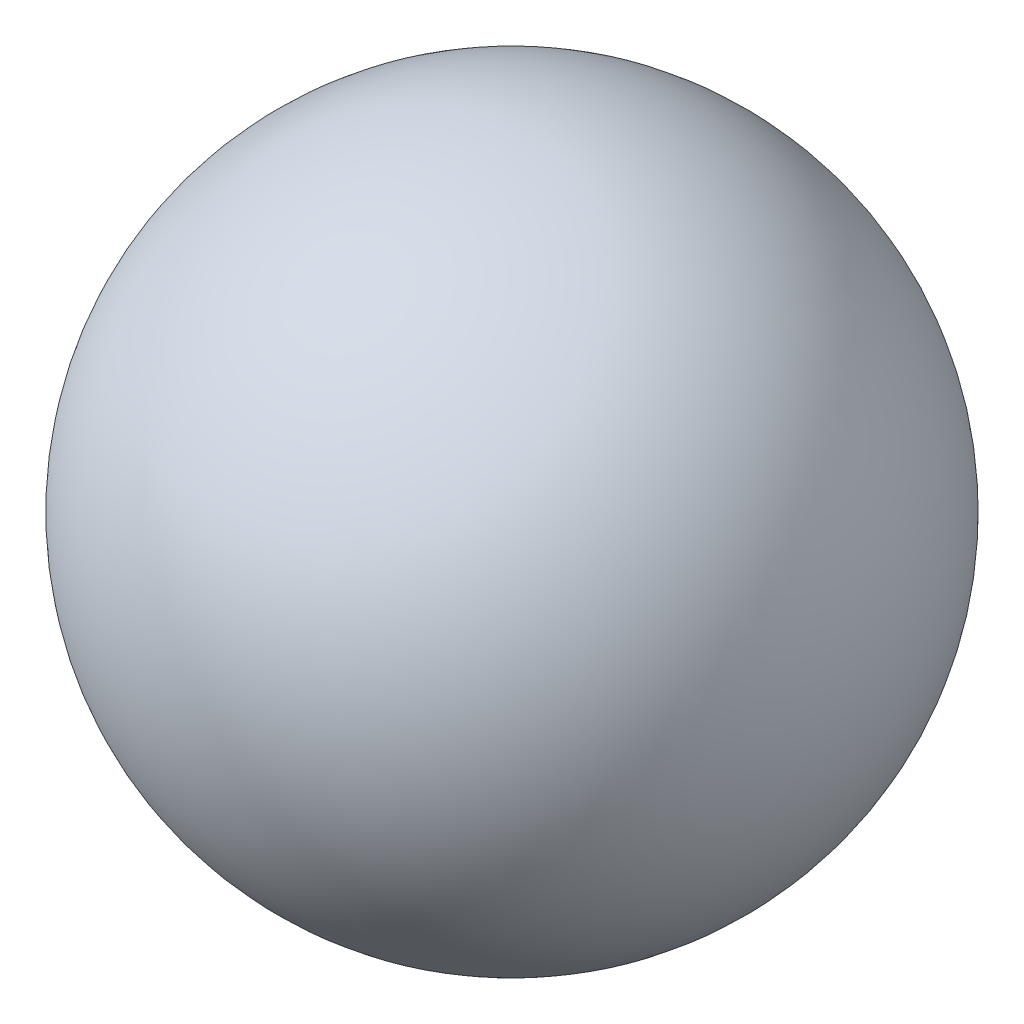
from build123d import *


with BuildPart() as part:
    # Sketch2 → Revolve1 (revolve)
    with BuildSketch(Plane(origin=(0, 0, 0), x_dir=(0, 0, -1), z_dir=(1, 0, 0))):
        with BuildLine():
            Line((0, 38.1), (0, -38.1))
            ThreePointArc((0, -38.1), (38.1, 0), (0, 38.1))
        make_face()
    revolve(axis=Axis((0, 52.591025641, 0), (0, -1, 0)))


solid = part.part
